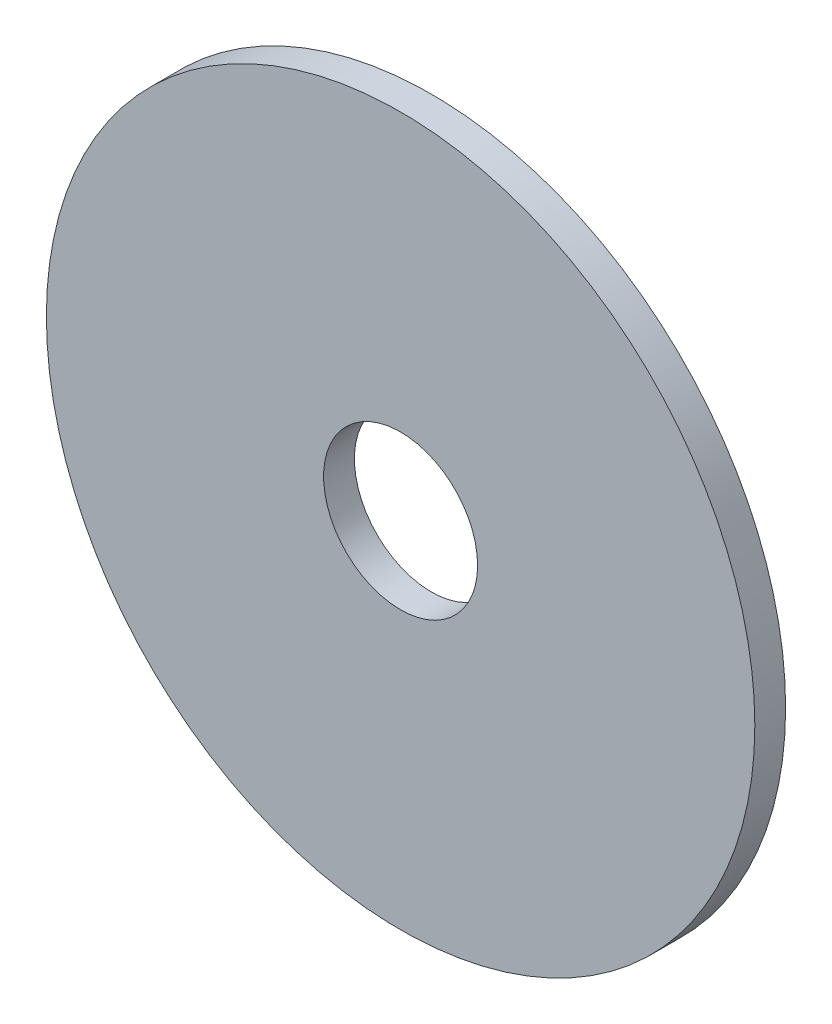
from build123d import *

# Parameters (mm, degrees)
ESQUISSE1_R      = 57.5
ESQUISSE1_R_2    = 12.5
EXTRUSION1_DEPTH = 5


with BuildPart() as part:
    # Esquisse1 → Extrusion1 (new body)
    with BuildSketch(Plane.XY):
        Circle(ESQUISSE1_R)
        Circle(ESQUISSE1_R_2, mode=Mode.SUBTRACT)
    extrude(amount=EXTRUSION1_DEPTH)


solid = part.part
